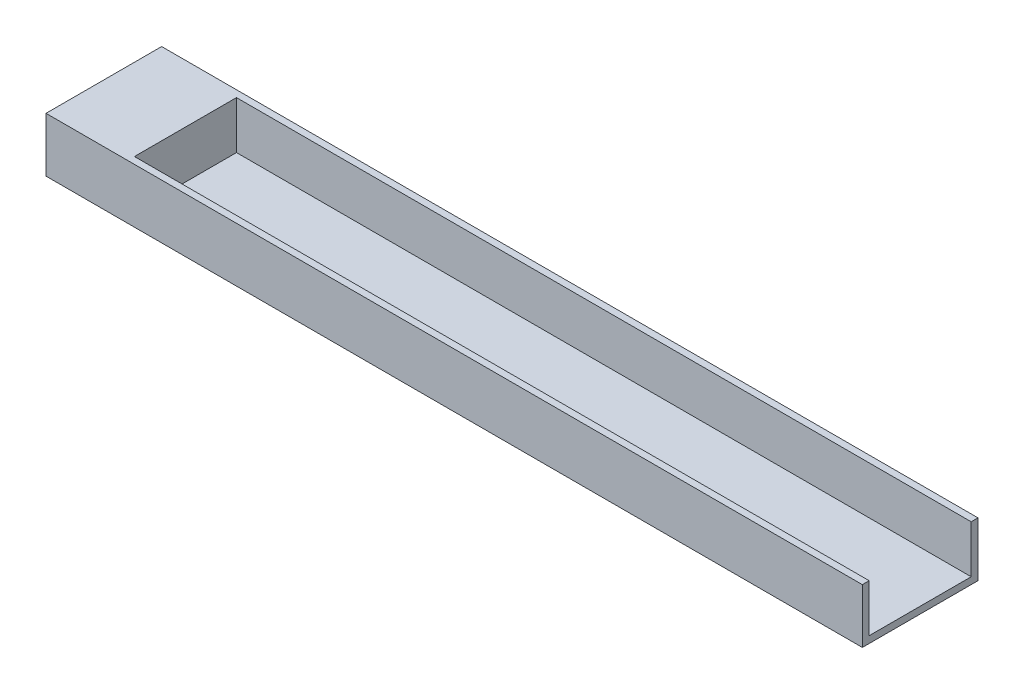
from build123d import *

# Parameters (mm, degrees)
SKETCH7_W           = 762
SKETCH7_H           = 107.95
BOSS_EXTRUDE2_DEPTH = 50.8
SKETCH8_W           = 95.25
SKETCH8_H           = 44.45
CUT_EXTRUDE1_DEPTH  = 685.8


with BuildPart() as part:
    # Sketch7 → Boss-Extrude2 (new body)
    with BuildSketch(Plane(origin=(0, 0, 0), x_dir=(1, 0, 0), z_dir=(0, 1, 0))):
        with Locations((381, 53.975)):
            Rectangle(SKETCH7_W, SKETCH7_H)
    extrude(amount=BOSS_EXTRUDE2_DEPTH)

    # Sketch8 → Cut-Extrude1 (cut)
    with BuildSketch(Plane(origin=(762, 0, 0), x_dir=(0, 0, -1), z_dir=(1, 0, 0))):
        with Locations((53.975, 28.575)):
            Rectangle(SKETCH8_W, SKETCH8_H)
    extrude(amount=-CUT_EXTRUDE1_DEPTH, mode=Mode.SUBTRACT)


solid = part.part
